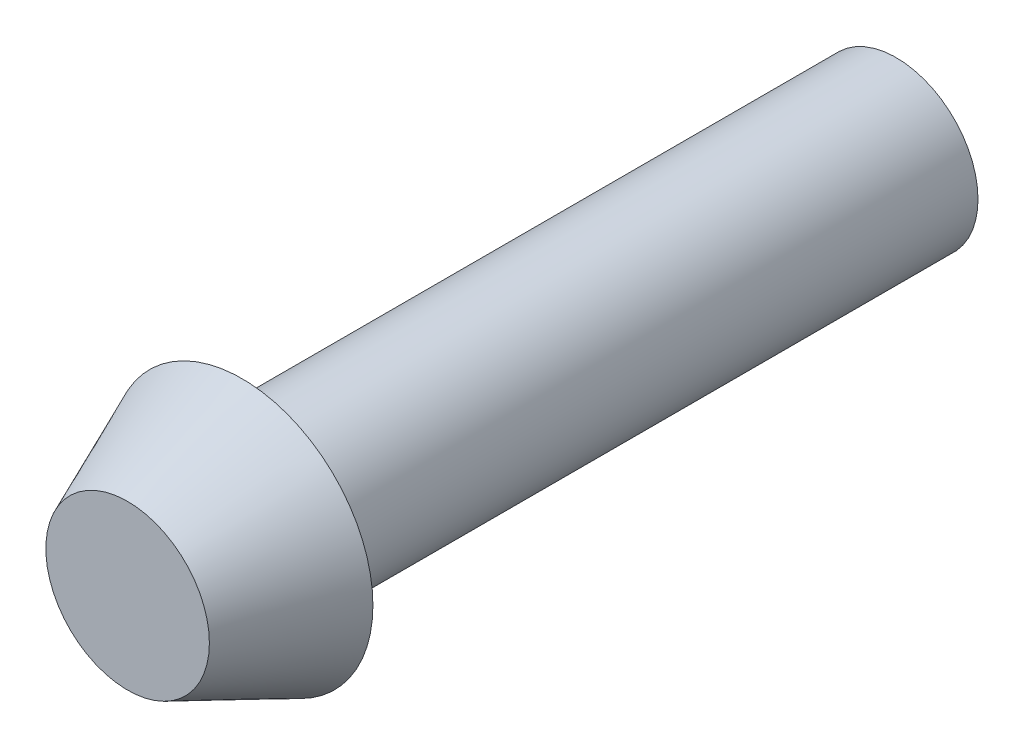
ISO-10303-21;
HEADER;
FILE_DESCRIPTION(('STEP AP214'),'2;1');
FILE_NAME('part.step','',(''),(''),'','','');
FILE_SCHEMA(('AUTOMOTIVE_DESIGN { 1 0 10303 214 1 1 1 1 }'));
ENDSEC;
DATA;
#1=APPLICATION_CONTEXT('core data for automotive mechanical design processes');
#2=APPLICATION_PROTOCOL_DEFINITION('international standard','automotive_design',2000,#1);
#3=PRODUCT_CONTEXT('',#1,'mechanical');
#4=PRODUCT('Part','Part','',(#3));
#5=PRODUCT_RELATED_PRODUCT_CATEGORY('part','',(#4));
#6=PRODUCT_DEFINITION_FORMATION('','',#4);
#7=PRODUCT_DEFINITION_CONTEXT('part definition',#1,'design');
#8=PRODUCT_DEFINITION('design','',#6,#7);
#9=PRODUCT_DEFINITION_SHAPE('','',#8);
#10=(LENGTH_UNIT() NAMED_UNIT(*) SI_UNIT(.MILLI.,.METRE.));
#11=(NAMED_UNIT(*) PLANE_ANGLE_UNIT() SI_UNIT($,.RADIAN.));
#12=(NAMED_UNIT(*) SI_UNIT($,.STERADIAN.) SOLID_ANGLE_UNIT());
#13=UNCERTAINTY_MEASURE_WITH_UNIT(LENGTH_MEASURE(1.E-05),#10,'distance_accuracy_value','');
#14=(GEOMETRIC_REPRESENTATION_CONTEXT(3) GLOBAL_UNCERTAINTY_ASSIGNED_CONTEXT((#13)) GLOBAL_UNIT_ASSIGNED_CONTEXT((#10,
#11,#12)) REPRESENTATION_CONTEXT('',''));
#15=CARTESIAN_POINT('',(0.,0.,0.));
#16=DIRECTION('',(0.,0.,1.));
#17=DIRECTION('',(1.,0.,0.));
#18=AXIS2_PLACEMENT_3D('',#15,#16,#17);
#19=CARTESIAN_POINT('',(0.,0.,0.));
#20=DIRECTION('',(0.,0.,-1.));
#21=DIRECTION('',(-1.,0.,0.));
#22=AXIS2_PLACEMENT_3D('',#19,#20,#21);
#23=PLANE('',#22);
#24=CARTESIAN_POINT('',(0.,0.,0.));
#25=DIRECTION('',(0.,0.,1.));
#26=DIRECTION('',(1.,0.,0.));
#27=AXIS2_PLACEMENT_3D('',#24,#25,#26);
#28=CIRCLE('',#27,3.175);
#29=CARTESIAN_POINT('',(3.175,0.,0.));
#30=VERTEX_POINT('',#29);
#31=EDGE_CURVE('E10',#30,#30,#28,.T.);
#32=ORIENTED_EDGE('',*,*,#31,.T.);
#33=EDGE_LOOP('',(#32));
#34=FACE_BOUND('',#33,.T.);
#35=ADVANCED_FACE('F31',(#34),#23,.F.);
#36=CARTESIAN_POINT('',(0.,0.,-4.445));
#37=DIRECTION('',(0.,0.,-1.));
#38=DIRECTION('',(-1.,0.,0.));
#39=AXIS2_PLACEMENT_3D('',#36,#37,#38);
#40=CONICAL_SURFACE('',#39,5.08,0.404891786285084);
#41=ORIENTED_EDGE('',*,*,#31,.F.);
#42=EDGE_LOOP('',(#41));
#43=FACE_BOUND('',#42,.T.);
#44=CARTESIAN_POINT('',(0.,0.,-4.445));
#45=DIRECTION('',(0.,0.,1.));
#46=DIRECTION('',(1.,0.,0.));
#47=AXIS2_PLACEMENT_3D('',#44,#45,#46);
#48=CIRCLE('',#47,5.08);
#49=CARTESIAN_POINT('',(5.08,0.,-4.445));
#50=VERTEX_POINT('',#49);
#51=EDGE_CURVE('E37',#50,#50,#48,.T.);
#52=ORIENTED_EDGE('',*,*,#51,.T.);
#53=EDGE_LOOP('',(#52));
#54=FACE_BOUND('',#53,.T.);
#55=ADVANCED_FACE('F63',(#43,#54),#40,.T.);
#56=CARTESIAN_POINT('',(-5.08,0.,-4.445));
#57=DIRECTION('',(0.,0.,1.));
#58=DIRECTION('',(1.,0.,0.));
#59=AXIS2_PLACEMENT_3D('',#56,#57,#58);
#60=PLANE('',#59);
#61=ORIENTED_EDGE('',*,*,#51,.F.);
#62=EDGE_LOOP('',(#61));
#63=FACE_BOUND('',#62,.T.);
#64=CARTESIAN_POINT('',(0.,0.,-4.445));
#65=DIRECTION('',(0.,0.,1.));
#66=DIRECTION('',(1.,0.,0.));
#67=AXIS2_PLACEMENT_3D('',#64,#65,#66);
#68=CIRCLE('',#67,3.175);
#69=CARTESIAN_POINT('',(3.175,0.,-4.445));
#70=VERTEX_POINT('',#69);
#71=EDGE_CURVE('E41',#70,#70,#68,.T.);
#72=ORIENTED_EDGE('',*,*,#71,.T.);
#73=EDGE_LOOP('',(#72));
#74=FACE_BOUND('',#73,.T.);
#75=ADVANCED_FACE('F59',(#63,#74),#60,.F.);
#76=CARTESIAN_POINT('',(0.,0.,0.));
#77=DIRECTION('',(0.,0.,1.));
#78=DIRECTION('',(1.,0.,0.));
#79=AXIS2_PLACEMENT_3D('',#76,#77,#78);
#80=CYLINDRICAL_SURFACE('',#79,3.175);
#81=ORIENTED_EDGE('',*,*,#71,.F.);
#82=EDGE_LOOP('',(#81));
#83=FACE_BOUND('',#82,.T.);
#84=CARTESIAN_POINT('',(0.,0.,-29.845));
#85=DIRECTION('',(0.,0.,1.));
#86=DIRECTION('',(1.,0.,0.));
#87=AXIS2_PLACEMENT_3D('',#84,#85,#86);
#88=CIRCLE('',#87,3.175);
#89=CARTESIAN_POINT('',(3.175,0.,-29.845));
#90=VERTEX_POINT('',#89);
#91=EDGE_CURVE('E45',#90,#90,#88,.T.);
#92=ORIENTED_EDGE('',*,*,#91,.T.);
#93=EDGE_LOOP('',(#92));
#94=FACE_BOUND('',#93,.T.);
#95=ADVANCED_FACE('F51',(#83,#94),#80,.T.);
#96=CARTESIAN_POINT('',(0.,0.,-29.845));
#97=DIRECTION('',(0.,0.,1.));
#98=DIRECTION('',(1.,0.,0.));
#99=AXIS2_PLACEMENT_3D('',#96,#97,#98);
#100=PLANE('',#99);
#101=ORIENTED_EDGE('',*,*,#91,.F.);
#102=EDGE_LOOP('',(#101));
#103=FACE_BOUND('',#102,.T.);
#104=ADVANCED_FACE('F53',(#103),#100,.F.);
#105=CLOSED_SHELL('',(#35,#55,#75,#95,#104));
#106=MANIFOLD_SOLID_BREP('B2',#105);
#107=ADVANCED_BREP_SHAPE_REPRESENTATION('',(#18,#106),#14);
#108=SHAPE_DEFINITION_REPRESENTATION(#9,#107);
ENDSEC;
END-ISO-10303-21;
